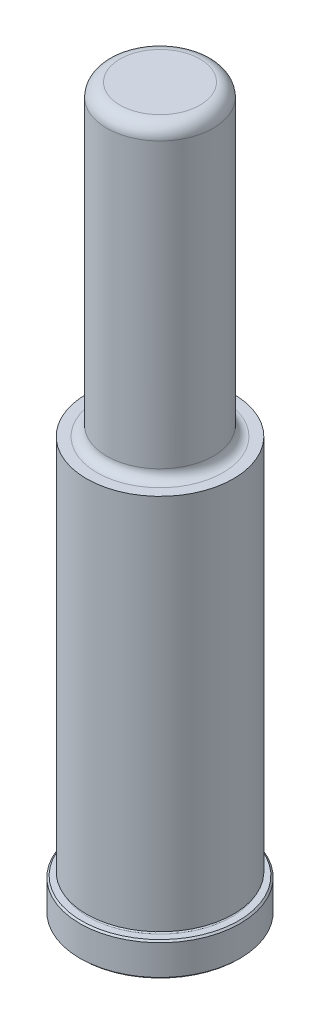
from build123d import *

# Parameters (mm, degrees)
CHAMFER1_SIZE = 0.381
FILLET7_R     = 3.175


with BuildPart() as part:
    # Sketch1 → Revolve1 (revolve)
    with BuildSketch(Plane(origin=(0, 0, 0), x_dir=(0, 0, -1), z_dir=(1, 0, 0)), mode=Mode.PRIVATE) as revolve1_sk:
        with BuildLine():
            Line((0, 0), (19.05, 0))
            Line((19.05, 0), (19.05, 7.9248))
            Line((19.05, 7.9248), (17.0688, 7.9248))
            ThreePointArc((17.0688, 7.9248), (16.6878, 8.3058), (17.0688, 8.6868))
            Line((17.0688, 8.6868), (17.4752, 8.6868))
            Line((17.4752, 8.6868), (17.4752, 98.425))
            Line((17.4752, 98.425), (14.9733, 98.425))
            ThreePointArc((14.9733, 98.425), (13.356853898, 99.094553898), (12.6873, 100.711))
            Line((12.6873, 100.711), (12.6873, 171.45))
            Line((12.6873, 171.45), (0, 171.45))
            Line((0, 171.45), (0, 0))
        make_face()
    revolve(revolve1_sk.sketch.rotate(Axis((0, 0, 0), (0, -1, 0)), 180), axis=Axis((0, 0, 0), (0, -1, 0)))

    # Chamfer1
    chamfer1_edges = [part.edges().sort_by_distance(p)[0] for p in [
        (0, 7.9248, -19.05),
        (0, 0, -19.05),
    ]]
    chamfer(chamfer1_edges, length=CHAMFER1_SIZE)

    # Fillet7
    fillet7_edges = [part.edges().sort_by_distance(p)[0] for p in [
        (0, 171.45, -12.6873),
    ]]
    fillet(fillet7_edges, radius=FILLET7_R)


solid = part.part
